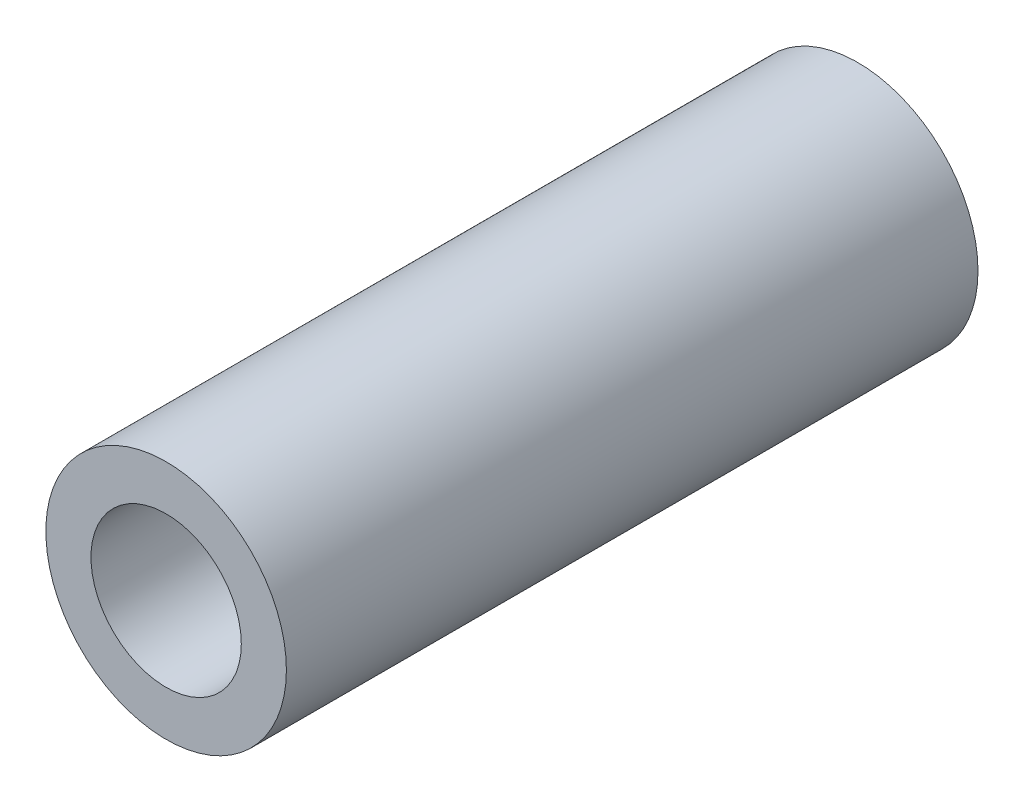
ISO-10303-21;
HEADER;
FILE_DESCRIPTION(('STEP AP214'),'2;1');
FILE_NAME('part.step','',(''),(''),'','','');
FILE_SCHEMA(('AUTOMOTIVE_DESIGN { 1 0 10303 214 1 1 1 1 }'));
ENDSEC;
DATA;
#1=APPLICATION_CONTEXT('core data for automotive mechanical design processes');
#2=APPLICATION_PROTOCOL_DEFINITION('international standard','automotive_design',2000,#1);
#3=PRODUCT_CONTEXT('',#1,'mechanical');
#4=PRODUCT('Part','Part','',(#3));
#5=PRODUCT_RELATED_PRODUCT_CATEGORY('part','',(#4));
#6=PRODUCT_DEFINITION_FORMATION('','',#4);
#7=PRODUCT_DEFINITION_CONTEXT('part definition',#1,'design');
#8=PRODUCT_DEFINITION('design','',#6,#7);
#9=PRODUCT_DEFINITION_SHAPE('','',#8);
#10=(LENGTH_UNIT() NAMED_UNIT(*) SI_UNIT(.MILLI.,.METRE.));
#11=(NAMED_UNIT(*) PLANE_ANGLE_UNIT() SI_UNIT($,.RADIAN.));
#12=(NAMED_UNIT(*) SI_UNIT($,.STERADIAN.) SOLID_ANGLE_UNIT());
#13=UNCERTAINTY_MEASURE_WITH_UNIT(LENGTH_MEASURE(1.E-05),#10,'distance_accuracy_value','');
#14=(GEOMETRIC_REPRESENTATION_CONTEXT(3) GLOBAL_UNCERTAINTY_ASSIGNED_CONTEXT((#13)) GLOBAL_UNIT_ASSIGNED_CONTEXT((#10,
#11,#12)) REPRESENTATION_CONTEXT('',''));
#15=CARTESIAN_POINT('',(0.,0.,0.));
#16=DIRECTION('',(0.,0.,1.));
#17=DIRECTION('',(1.,0.,0.));
#18=AXIS2_PLACEMENT_3D('',#15,#16,#17);
#19=CARTESIAN_POINT('',(0.,0.,23.));
#20=DIRECTION('',(0.,0.,1.));
#21=DIRECTION('',(1.,0.,0.));
#22=AXIS2_PLACEMENT_3D('',#19,#20,#21);
#23=PLANE('',#22);
#24=CARTESIAN_POINT('',(0.,0.,23.));
#25=DIRECTION('',(0.,0.,1.));
#26=DIRECTION('',(1.,0.,0.));
#27=AXIS2_PLACEMENT_3D('',#24,#25,#26);
#28=CIRCLE('',#27,4.);
#29=CARTESIAN_POINT('',(4.,0.,23.));
#30=VERTEX_POINT('',#29);
#31=EDGE_CURVE('E10',#30,#30,#28,.T.);
#32=ORIENTED_EDGE('',*,*,#31,.T.);
#33=EDGE_LOOP('',(#32));
#34=FACE_BOUND('',#33,.T.);
#35=CARTESIAN_POINT('',(0.,0.,23.));
#36=DIRECTION('',(0.,0.,1.));
#37=DIRECTION('',(1.,0.,0.));
#38=AXIS2_PLACEMENT_3D('',#35,#36,#37);
#39=CIRCLE('',#38,2.5);
#40=CARTESIAN_POINT('',(2.5,0.,23.));
#41=VERTEX_POINT('',#40);
#42=EDGE_CURVE('E43',#41,#41,#39,.T.);
#43=ORIENTED_EDGE('',*,*,#42,.F.);
#44=EDGE_LOOP('',(#43));
#45=FACE_BOUND('',#44,.T.);
#46=ADVANCED_FACE('F32',(#34,#45),#23,.T.);
#47=CARTESIAN_POINT('',(0.,0.,0.));
#48=DIRECTION('',(0.,0.,1.));
#49=DIRECTION('',(1.,0.,0.));
#50=AXIS2_PLACEMENT_3D('',#47,#48,#49);
#51=PLANE('',#50);
#52=CARTESIAN_POINT('',(0.,0.,0.));
#53=DIRECTION('',(0.,0.,1.));
#54=DIRECTION('',(1.,0.,0.));
#55=AXIS2_PLACEMENT_3D('',#52,#53,#54);
#56=CIRCLE('',#55,4.);
#57=CARTESIAN_POINT('',(4.,0.,0.));
#58=VERTEX_POINT('',#57);
#59=EDGE_CURVE('E36',#58,#58,#56,.T.);
#60=ORIENTED_EDGE('',*,*,#59,.F.);
#61=EDGE_LOOP('',(#60));
#62=FACE_BOUND('',#61,.T.);
#63=CARTESIAN_POINT('',(0.,0.,0.));
#64=DIRECTION('',(0.,0.,1.));
#65=DIRECTION('',(1.,0.,0.));
#66=AXIS2_PLACEMENT_3D('',#63,#64,#65);
#67=CIRCLE('',#66,2.5);
#68=CARTESIAN_POINT('',(2.5,0.,0.));
#69=VERTEX_POINT('',#68);
#70=EDGE_CURVE('E45',#69,#69,#67,.T.);
#71=ORIENTED_EDGE('',*,*,#70,.T.);
#72=EDGE_LOOP('',(#71));
#73=FACE_BOUND('',#72,.T.);
#74=ADVANCED_FACE('F55',(#62,#73),#51,.F.);
#75=CARTESIAN_POINT('',(0.,0.,23.));
#76=DIRECTION('',(0.,0.,-1.));
#77=DIRECTION('',(-1.,0.,0.));
#78=AXIS2_PLACEMENT_3D('',#75,#76,#77);
#79=CYLINDRICAL_SURFACE('',#78,4.);
#80=ORIENTED_EDGE('',*,*,#31,.F.);
#81=EDGE_LOOP('',(#80));
#82=FACE_BOUND('',#81,.T.);
#83=ORIENTED_EDGE('',*,*,#59,.T.);
#84=EDGE_LOOP('',(#83));
#85=FACE_BOUND('',#84,.T.);
#86=ADVANCED_FACE('F34',(#82,#85),#79,.T.);
#87=CARTESIAN_POINT('',(0.,0.,23.));
#88=DIRECTION('',(0.,0.,-1.));
#89=DIRECTION('',(-1.,0.,0.));
#90=AXIS2_PLACEMENT_3D('',#87,#88,#89);
#91=CYLINDRICAL_SURFACE('',#90,2.5);
#92=ORIENTED_EDGE('',*,*,#42,.T.);
#93=EDGE_LOOP('',(#92));
#94=FACE_BOUND('',#93,.T.);
#95=ORIENTED_EDGE('',*,*,#70,.F.);
#96=EDGE_LOOP('',(#95));
#97=FACE_BOUND('',#96,.T.);
#98=ADVANCED_FACE('F51',(#94,#97),#91,.F.);
#99=CLOSED_SHELL('',(#46,#74,#86,#98));
#100=MANIFOLD_SOLID_BREP('B2',#99);
#101=ADVANCED_BREP_SHAPE_REPRESENTATION('',(#18,#100),#14);
#102=SHAPE_DEFINITION_REPRESENTATION(#9,#101);
ENDSEC;
END-ISO-10303-21;
